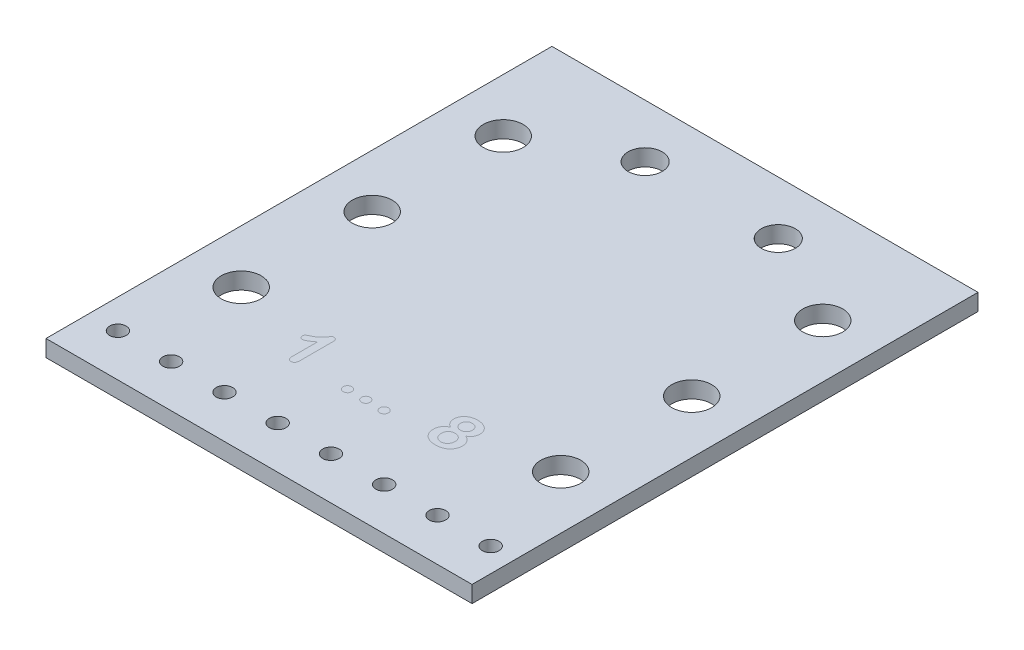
from build123d import *

# Parameters (mm, degrees)
SKETCH1_W           = 40.64
SKETCH1_H           = 48.26
SKETCH1_R           = 1.905
BOSS_EXTRUDE1_DEPTH = 1.5875
SKETCH2_R           = 0.7874
SCREWHOLES_DEPTH    = 64.112259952
SKETCH3_R           = 1.6256
CUT_EXTRUDE2_DEPTH  = 64.112259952


with BuildPart() as part:
    # Sketch1 → Boss-Extrude1 (new body)
    with BuildSketch(Plane(origin=(0, 0, 0), x_dir=(1, 0, 0), z_dir=(0, 1, 0))):
        with Locations((20.32, 24.13)):
            Rectangle(SKETCH1_W, SKETCH1_H)
        with Locations(Location((5.08, 13.5382, 0), (0, 0, 270))):
            Circle(SKETCH1_R, mode=Mode.SUBTRACT)
        with Locations(Location((5.08, 38.53434, 0), (0, 0, 270))):
            Circle(SKETCH1_R, mode=Mode.SUBTRACT)
        with Locations(Location((35.56, 13.5382, 0), (0, 0, 90))):
            Circle(SKETCH1_R, mode=Mode.SUBTRACT)
        with Locations(Location((35.56, 38.53434, 0), (0, 0, 90))):
            Circle(SKETCH1_R, mode=Mode.SUBTRACT)
        with Locations(Location((5.08, 26.035, 0), (0, 0, 270))):
            Circle(SKETCH1_R, mode=Mode.SUBTRACT)
        with Locations(Location((35.56, 26.035, 0), (0, 0, 90))):
            Circle(SKETCH1_R, mode=Mode.SUBTRACT)
    extrude(amount=-BOSS_EXTRUDE1_DEPTH)

    # Sketch2 → screwHoles (cut, through all)
    with BuildSketch(Plane(origin=(0, 0, 0), x_dir=(1, 0, 0), z_dir=(0, 1, 0))):
        with Locations(Location((2.794, 4.064, 0), (0, 0, 270))):
            Circle(SKETCH2_R)
        with Locations(Location((7.874, 4.064, 0), (0, 0, 270))):
            Circle(SKETCH2_R)
        with Locations(Location((12.954, 4.064, 0), (0, 0, 270))):
            Circle(SKETCH2_R)
        with Locations(Location((18.034, 4.064, 0), (0, 0, 270))):
            Circle(SKETCH2_R)
        with Locations(Location((23.114, 4.064, 0), (0, 0, 270))):
            Circle(SKETCH2_R)
        with Locations(Location((28.194, 4.064, 0), (0, 0, 270))):
            Circle(SKETCH2_R)
        with Locations(Location((33.274, 4.064, 0), (0, 0, 270))):
            Circle(SKETCH2_R)
        with Locations(Location((38.354, 4.064, 0), (0, 0, 270))):
            Circle(SKETCH2_R)
    extrude(amount=-SCREWHOLES_DEPTH, mode=Mode.SUBTRACT)

    # Sketch3 → Cut-Extrude2 (cut, through all)
    with BuildSketch(Plane(origin=(0, 0, 0), x_dir=(1, 0, 0), z_dir=(0, 1, 0))):
        with Locations(Location((13.97, 43.18, 0), (0, 0, 270))):
            Circle(SKETCH3_R)
        with Locations(Location((26.67, 43.18, 0), (0, 0, 270))):
            Circle(SKETCH3_R)
    extrude(amount=-CUT_EXTRUDE2_DEPTH, mode=Mode.SUBTRACT)


solid = part.part
